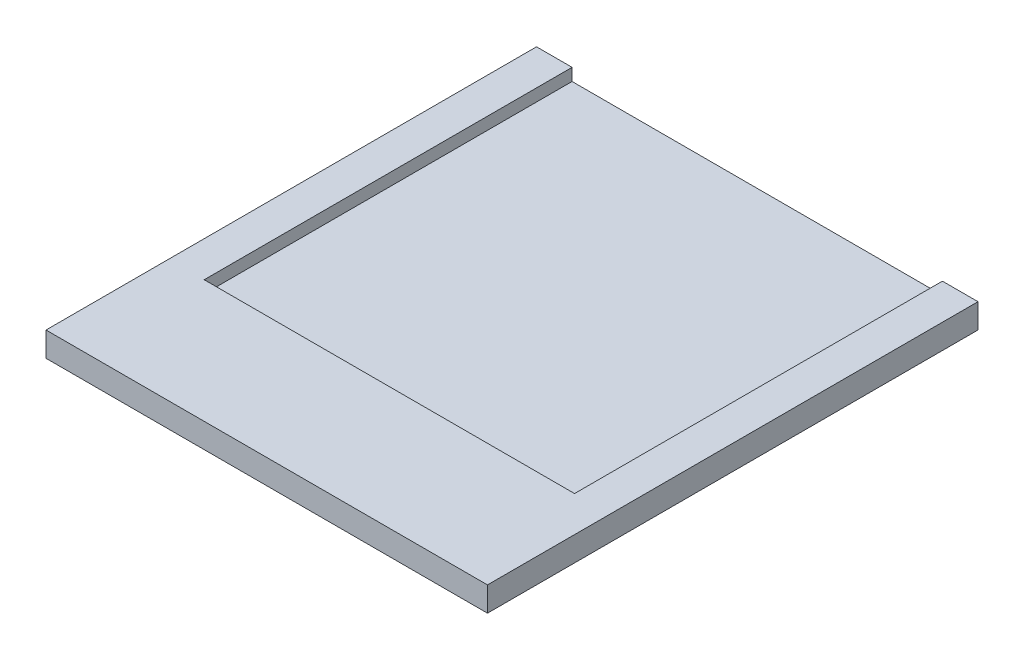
ISO-10303-21;
HEADER;
FILE_DESCRIPTION(('STEP AP214'),'2;1');
FILE_NAME('part.step','',(''),(''),'','','');
FILE_SCHEMA(('AUTOMOTIVE_DESIGN { 1 0 10303 214 1 1 1 1 }'));
ENDSEC;
DATA;
#1=APPLICATION_CONTEXT('core data for automotive mechanical design processes');
#2=APPLICATION_PROTOCOL_DEFINITION('international standard','automotive_design',2000,#1);
#3=PRODUCT_CONTEXT('',#1,'mechanical');
#4=PRODUCT('Part','Part','',(#3));
#5=PRODUCT_RELATED_PRODUCT_CATEGORY('part','',(#4));
#6=PRODUCT_DEFINITION_FORMATION('','',#4);
#7=PRODUCT_DEFINITION_CONTEXT('part definition',#1,'design');
#8=PRODUCT_DEFINITION('design','',#6,#7);
#9=PRODUCT_DEFINITION_SHAPE('','',#8);
#10=(LENGTH_UNIT() NAMED_UNIT(*) SI_UNIT(.MILLI.,.METRE.));
#11=(NAMED_UNIT(*) PLANE_ANGLE_UNIT() SI_UNIT($,.RADIAN.));
#12=(NAMED_UNIT(*) SI_UNIT($,.STERADIAN.) SOLID_ANGLE_UNIT());
#13=UNCERTAINTY_MEASURE_WITH_UNIT(LENGTH_MEASURE(1.E-05),#10,'distance_accuracy_value','');
#14=(GEOMETRIC_REPRESENTATION_CONTEXT(3) GLOBAL_UNCERTAINTY_ASSIGNED_CONTEXT((#13)) GLOBAL_UNIT_ASSIGNED_CONTEXT((#10,
#11,#12)) REPRESENTATION_CONTEXT('',''));
#15=CARTESIAN_POINT('',(0.,0.,0.));
#16=DIRECTION('',(0.,0.,1.));
#17=DIRECTION('',(1.,0.,0.));
#18=AXIS2_PLACEMENT_3D('',#15,#16,#17);
#19=CARTESIAN_POINT('',(-90.,10.,100.));
#20=DIRECTION('',(1.,0.,0.));
#21=DIRECTION('',(0.,0.,-1.));
#22=AXIS2_PLACEMENT_3D('',#19,#20,#21);
#23=PLANE('',#22);
#24=DIRECTION('',(0.,0.,1.));
#25=VECTOR('',#24,1.);
#26=CARTESIAN_POINT('',(-90.,0.,100.));
#27=LINE('',#26,#25);
#28=CARTESIAN_POINT('',(-90.,0.,-100.));
#29=VERTEX_POINT('',#28);
#30=CARTESIAN_POINT('',(-90.,0.,100.));
#31=VERTEX_POINT('',#30);
#32=EDGE_CURVE('E141',#29,#31,#27,.T.);
#33=ORIENTED_EDGE('',*,*,#32,.T.);
#34=DIRECTION('',(0.,-1.,0.));
#35=VECTOR('',#34,1.);
#36=CARTESIAN_POINT('',(-90.,10.,100.));
#37=LINE('',#36,#35);
#38=CARTESIAN_POINT('',(-90.,10.,100.));
#39=VERTEX_POINT('',#38);
#40=EDGE_CURVE('E12',#39,#31,#37,.T.);
#41=ORIENTED_EDGE('',*,*,#40,.F.);
#42=DIRECTION('',(0.,0.,1.));
#43=VECTOR('',#42,1.);
#44=CARTESIAN_POINT('',(-90.,10.,100.));
#45=LINE('',#44,#43);
#46=CARTESIAN_POINT('',(-90.,10.,-100.));
#47=VERTEX_POINT('',#46);
#48=EDGE_CURVE('E148',#47,#39,#45,.T.);
#49=ORIENTED_EDGE('',*,*,#48,.F.);
#50=DIRECTION('',(0.,-1.,0.));
#51=VECTOR('',#50,1.);
#52=CARTESIAN_POINT('',(-90.,10.,-100.));
#53=LINE('',#52,#51);
#54=EDGE_CURVE('E160',#47,#29,#53,.T.);
#55=ORIENTED_EDGE('',*,*,#54,.T.);
#56=EDGE_LOOP('',(#33,#41,#49,#55));
#57=FACE_BOUND('',#56,.T.);
#58=ADVANCED_FACE('F19',(#57),#23,.F.);
#59=CARTESIAN_POINT('',(90.,10.,100.));
#60=DIRECTION('',(0.,0.,-1.));
#61=DIRECTION('',(-1.,0.,0.));
#62=AXIS2_PLACEMENT_3D('',#59,#60,#61);
#63=PLANE('',#62);
#64=DIRECTION('',(1.,0.,0.));
#65=VECTOR('',#64,1.);
#66=CARTESIAN_POINT('',(90.,0.,100.));
#67=LINE('',#66,#65);
#68=CARTESIAN_POINT('',(90.,0.,100.));
#69=VERTEX_POINT('',#68);
#70=EDGE_CURVE('E165',#31,#69,#67,.T.);
#71=ORIENTED_EDGE('',*,*,#70,.T.);
#72=DIRECTION('',(0.,-1.,0.));
#73=VECTOR('',#72,1.);
#74=CARTESIAN_POINT('',(90.,10.,100.));
#75=LINE('',#74,#73);
#76=CARTESIAN_POINT('',(90.,10.,100.));
#77=VERTEX_POINT('',#76);
#78=EDGE_CURVE('E27',#77,#69,#75,.T.);
#79=ORIENTED_EDGE('',*,*,#78,.F.);
#80=DIRECTION('',(1.,0.,0.));
#81=VECTOR('',#80,1.);
#82=CARTESIAN_POINT('',(90.,10.,100.));
#83=LINE('',#82,#81);
#84=EDGE_CURVE('E71',#39,#77,#83,.T.);
#85=ORIENTED_EDGE('',*,*,#84,.F.);
#86=ORIENTED_EDGE('',*,*,#40,.T.);
#87=EDGE_LOOP('',(#71,#79,#85,#86));
#88=FACE_BOUND('',#87,.T.);
#89=ADVANCED_FACE('F198',(#88),#63,.F.);
#90=CARTESIAN_POINT('',(90.,10.,100.));
#91=DIRECTION('',(-1.,0.,0.));
#92=DIRECTION('',(0.,0.,1.));
#93=AXIS2_PLACEMENT_3D('',#90,#91,#92);
#94=PLANE('',#93);
#95=DIRECTION('',(0.,0.,-1.));
#96=VECTOR('',#95,1.);
#97=CARTESIAN_POINT('',(90.,0.,100.));
#98=LINE('',#97,#96);
#99=CARTESIAN_POINT('',(90.,0.,-100.));
#100=VERTEX_POINT('',#99);
#101=EDGE_CURVE('E170',#69,#100,#98,.T.);
#102=ORIENTED_EDGE('',*,*,#101,.T.);
#103=DIRECTION('',(0.,-1.,0.));
#104=VECTOR('',#103,1.);
#105=CARTESIAN_POINT('',(90.,10.,-100.));
#106=LINE('',#105,#104);
#107=CARTESIAN_POINT('',(90.,10.,-100.));
#108=VERTEX_POINT('',#107);
#109=EDGE_CURVE('E178',#108,#100,#106,.T.);
#110=ORIENTED_EDGE('',*,*,#109,.F.);
#111=DIRECTION('',(0.,0.,-1.));
#112=VECTOR('',#111,1.);
#113=CARTESIAN_POINT('',(90.,10.,100.));
#114=LINE('',#113,#112);
#115=EDGE_CURVE('E153',#77,#108,#114,.T.);
#116=ORIENTED_EDGE('',*,*,#115,.F.);
#117=ORIENTED_EDGE('',*,*,#78,.T.);
#118=EDGE_LOOP('',(#102,#110,#116,#117));
#119=FACE_BOUND('',#118,.T.);
#120=ADVANCED_FACE('F185',(#119),#94,.F.);
#121=CARTESIAN_POINT('',(90.,10.,-100.));
#122=DIRECTION('',(0.,0.,1.));
#123=DIRECTION('',(1.,0.,0.));
#124=AXIS2_PLACEMENT_3D('',#121,#122,#123);
#125=PLANE('',#124);
#126=DIRECTION('',(-1.,0.,0.));
#127=VECTOR('',#126,1.);
#128=CARTESIAN_POINT('',(90.,10.,-100.));
#129=LINE('',#128,#127);
#130=CARTESIAN_POINT('',(-75.5,10.,-100.));
#131=VERTEX_POINT('',#130);
#132=EDGE_CURVE('E42',#131,#47,#129,.T.);
#133=ORIENTED_EDGE('',*,*,#132,.F.);
#134=DIRECTION('',(0.,1.,0.));
#135=VECTOR('',#134,1.);
#136=CARTESIAN_POINT('',(-75.5,5.,-100.));
#137=LINE('',#136,#135);
#138=CARTESIAN_POINT('',(-75.5,5.,-100.));
#139=VERTEX_POINT('',#138);
#140=EDGE_CURVE('E138',#139,#131,#137,.T.);
#141=ORIENTED_EDGE('',*,*,#140,.F.);
#142=DIRECTION('',(-1.,0.,0.));
#143=VECTOR('',#142,1.);
#144=CARTESIAN_POINT('',(-75.5,5.,-100.));
#145=LINE('',#144,#143);
#146=CARTESIAN_POINT('',(75.5,5.,-100.));
#147=VERTEX_POINT('',#146);
#148=EDGE_CURVE('E101',#147,#139,#145,.T.);
#149=ORIENTED_EDGE('',*,*,#148,.F.);
#150=DIRECTION('',(0.,1.,0.));
#151=VECTOR('',#150,1.);
#152=CARTESIAN_POINT('',(75.5,5.,-100.));
#153=LINE('',#152,#151);
#154=CARTESIAN_POINT('',(75.5,10.,-100.));
#155=VERTEX_POINT('',#154);
#156=EDGE_CURVE('E142',#147,#155,#153,.T.);
#157=ORIENTED_EDGE('',*,*,#156,.T.);
#158=EDGE_CURVE('E155',#108,#155,#129,.T.);
#159=ORIENTED_EDGE('',*,*,#158,.F.);
#160=ORIENTED_EDGE('',*,*,#109,.T.);
#161=DIRECTION('',(-1.,0.,0.));
#162=VECTOR('',#161,1.);
#163=CARTESIAN_POINT('',(90.,0.,-100.));
#164=LINE('',#163,#162);
#165=EDGE_CURVE('E64',#100,#29,#164,.T.);
#166=ORIENTED_EDGE('',*,*,#165,.T.);
#167=ORIENTED_EDGE('',*,*,#54,.F.);
#168=EDGE_LOOP('',(#133,#141,#149,#157,#159,#160,#166,#167));
#169=FACE_BOUND('',#168,.T.);
#170=ADVANCED_FACE('F193',(#169),#125,.F.);
#171=CARTESIAN_POINT('',(0.,10.,0.));
#172=DIRECTION('',(0.,1.,0.));
#173=DIRECTION('',(0.,0.,1.));
#174=AXIS2_PLACEMENT_3D('',#171,#172,#173);
#175=PLANE('',#174);
#176=DIRECTION('',(0.,0.,1.));
#177=VECTOR('',#176,1.);
#178=CARTESIAN_POINT('',(-75.5,10.,-100.));
#179=LINE('',#178,#177);
#180=CARTESIAN_POINT('',(-75.5,10.,50.));
#181=VERTEX_POINT('',#180);
#182=EDGE_CURVE('E34',#131,#181,#179,.T.);
#183=ORIENTED_EDGE('',*,*,#182,.F.);
#184=ORIENTED_EDGE('',*,*,#132,.T.);
#185=ORIENTED_EDGE('',*,*,#48,.T.);
#186=ORIENTED_EDGE('',*,*,#84,.T.);
#187=ORIENTED_EDGE('',*,*,#115,.T.);
#188=ORIENTED_EDGE('',*,*,#158,.T.);
#189=DIRECTION('',(0.,0.,-1.));
#190=VECTOR('',#189,1.);
#191=CARTESIAN_POINT('',(75.5,10.,-100.));
#192=LINE('',#191,#190);
#193=CARTESIAN_POINT('',(75.5,10.,50.));
#194=VERTEX_POINT('',#193);
#195=EDGE_CURVE('E116',#194,#155,#192,.T.);
#196=ORIENTED_EDGE('',*,*,#195,.F.);
#197=DIRECTION('',(1.,0.,0.));
#198=VECTOR('',#197,1.);
#199=CARTESIAN_POINT('',(-75.5,10.,50.));
#200=LINE('',#199,#198);
#201=EDGE_CURVE('E119',#181,#194,#200,.T.);
#202=ORIENTED_EDGE('',*,*,#201,.F.);
#203=EDGE_LOOP('',(#183,#184,#185,#186,#187,#188,#196,#202));
#204=FACE_BOUND('',#203,.T.);
#205=ADVANCED_FACE('F209',(#204),#175,.T.);
#206=CARTESIAN_POINT('',(0.,0.,0.));
#207=DIRECTION('',(0.,1.,0.));
#208=DIRECTION('',(0.,0.,1.));
#209=AXIS2_PLACEMENT_3D('',#206,#207,#208);
#210=PLANE('',#209);
#211=ORIENTED_EDGE('',*,*,#32,.F.);
#212=ORIENTED_EDGE('',*,*,#165,.F.);
#213=ORIENTED_EDGE('',*,*,#101,.F.);
#214=ORIENTED_EDGE('',*,*,#70,.F.);
#215=EDGE_LOOP('',(#211,#212,#213,#214));
#216=FACE_BOUND('',#215,.T.);
#217=ADVANCED_FACE('F189',(#216),#210,.F.);
#218=CARTESIAN_POINT('',(-75.5,5.,-100.));
#219=DIRECTION('',(-1.,0.,0.));
#220=DIRECTION('',(0.,0.,1.));
#221=AXIS2_PLACEMENT_3D('',#218,#219,#220);
#222=PLANE('',#221);
#223=ORIENTED_EDGE('',*,*,#182,.T.);
#224=DIRECTION('',(0.,1.,0.));
#225=VECTOR('',#224,1.);
#226=CARTESIAN_POINT('',(-75.5,5.,50.));
#227=LINE('',#226,#225);
#228=CARTESIAN_POINT('',(-75.5,5.,50.));
#229=VERTEX_POINT('',#228);
#230=EDGE_CURVE('E90',#229,#181,#227,.T.);
#231=ORIENTED_EDGE('',*,*,#230,.F.);
#232=DIRECTION('',(0.,0.,1.));
#233=VECTOR('',#232,1.);
#234=CARTESIAN_POINT('',(-75.5,5.,-100.));
#235=LINE('',#234,#233);
#236=EDGE_CURVE('E94',#139,#229,#235,.T.);
#237=ORIENTED_EDGE('',*,*,#236,.F.);
#238=ORIENTED_EDGE('',*,*,#140,.T.);
#239=EDGE_LOOP('',(#223,#231,#237,#238));
#240=FACE_BOUND('',#239,.T.);
#241=ADVANCED_FACE('F92',(#240),#222,.F.);
#242=CARTESIAN_POINT('',(75.5,5.,-100.));
#243=DIRECTION('',(1.,0.,0.));
#244=DIRECTION('',(0.,0.,-1.));
#245=AXIS2_PLACEMENT_3D('',#242,#243,#244);
#246=PLANE('',#245);
#247=ORIENTED_EDGE('',*,*,#195,.T.);
#248=ORIENTED_EDGE('',*,*,#156,.F.);
#249=DIRECTION('',(0.,0.,-1.));
#250=VECTOR('',#249,1.);
#251=CARTESIAN_POINT('',(75.5,5.,-100.));
#252=LINE('',#251,#250);
#253=CARTESIAN_POINT('',(75.5,5.,50.));
#254=VERTEX_POINT('',#253);
#255=EDGE_CURVE('E110',#254,#147,#252,.T.);
#256=ORIENTED_EDGE('',*,*,#255,.F.);
#257=DIRECTION('',(0.,1.,0.));
#258=VECTOR('',#257,1.);
#259=CARTESIAN_POINT('',(75.5,5.,50.));
#260=LINE('',#259,#258);
#261=EDGE_CURVE('E100',#254,#194,#260,.T.);
#262=ORIENTED_EDGE('',*,*,#261,.T.);
#263=EDGE_LOOP('',(#247,#248,#256,#262));
#264=FACE_BOUND('',#263,.T.);
#265=ADVANCED_FACE('F216',(#264),#246,.F.);
#266=CARTESIAN_POINT('',(-75.5,5.,50.));
#267=DIRECTION('',(0.,0.,1.));
#268=DIRECTION('',(1.,0.,0.));
#269=AXIS2_PLACEMENT_3D('',#266,#267,#268);
#270=PLANE('',#269);
#271=ORIENTED_EDGE('',*,*,#201,.T.);
#272=ORIENTED_EDGE('',*,*,#261,.F.);
#273=DIRECTION('',(1.,0.,0.));
#274=VECTOR('',#273,1.);
#275=CARTESIAN_POINT('',(-75.5,5.,50.));
#276=LINE('',#275,#274);
#277=EDGE_CURVE('E104',#229,#254,#276,.T.);
#278=ORIENTED_EDGE('',*,*,#277,.F.);
#279=ORIENTED_EDGE('',*,*,#230,.T.);
#280=EDGE_LOOP('',(#271,#272,#278,#279));
#281=FACE_BOUND('',#280,.T.);
#282=ADVANCED_FACE('F105',(#281),#270,.F.);
#283=CARTESIAN_POINT('',(0.,5.,0.));
#284=DIRECTION('',(0.,1.,0.));
#285=DIRECTION('',(0.,0.,1.));
#286=AXIS2_PLACEMENT_3D('',#283,#284,#285);
#287=PLANE('',#286);
#288=ORIENTED_EDGE('',*,*,#236,.T.);
#289=ORIENTED_EDGE('',*,*,#277,.T.);
#290=ORIENTED_EDGE('',*,*,#255,.T.);
#291=ORIENTED_EDGE('',*,*,#148,.T.);
#292=EDGE_LOOP('',(#288,#289,#290,#291));
#293=FACE_BOUND('',#292,.T.);
#294=ADVANCED_FACE('F112',(#293),#287,.T.);
#295=CLOSED_SHELL('',(#58,#89,#120,#170,#205,#217,#241,#265,#282,#294));
#296=MANIFOLD_SOLID_BREP('B1',#295);
#297=ADVANCED_BREP_SHAPE_REPRESENTATION('',(#18,#296),#14);
#298=SHAPE_DEFINITION_REPRESENTATION(#9,#297);
ENDSEC;
END-ISO-10303-21;
